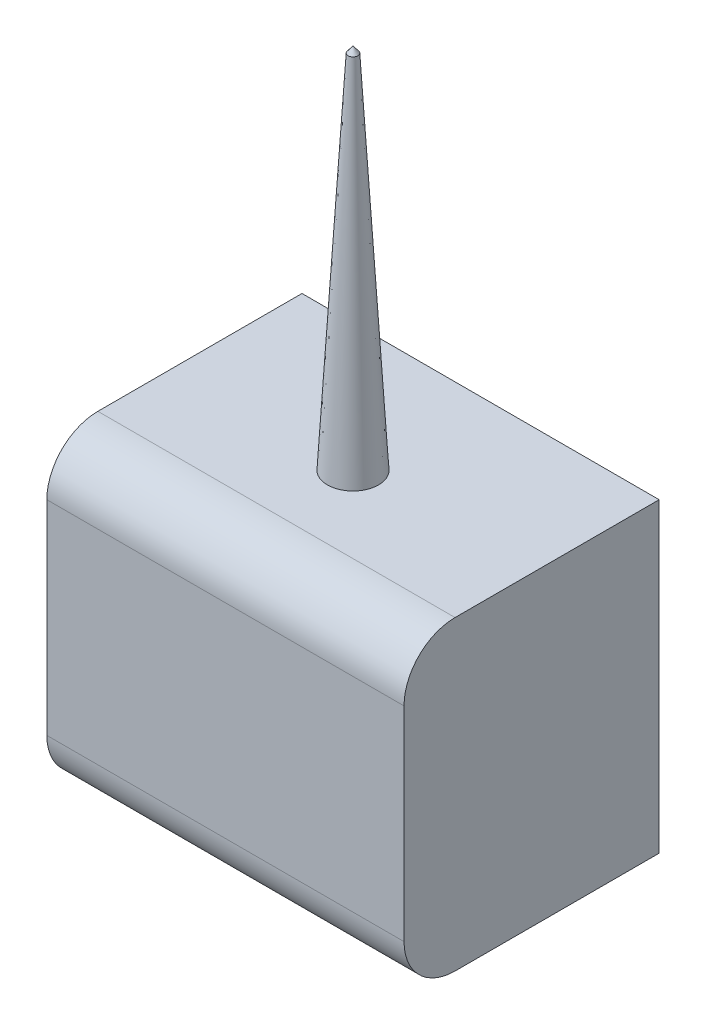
from build123d import *

# Parameters (mm, degrees)
ESQUISSE1_W      = 70
ESQUISSE1_H      = 60
EXTRUSION1_DEPTH = 50
CONG_1_R         = 10
ESQUISSE4_R      = 2.5
EXTRUSION2_DEPTH = 2
ESQUISSE5_W      = 10
ESQUISSE5_H      = 10
ESQUISSE5_R      = 2.5
EXTRUSION3_DEPTH = 2


with BuildPart() as part:
    # Esquisse1 → Extrusion1 (new body)
    with BuildSketch(Plane.XY):
        with Locations((35, 30)):
            Rectangle(ESQUISSE1_W, ESQUISSE1_H)
    extrude(amount=EXTRUSION1_DEPTH)

    # Cong_1
    cong_1_edges = [part.edges().sort_by_distance(p)[0] for p in [
        (35, 60, 50),
        (35, 0, 50),
    ]]
    fillet(cong_1_edges, radius=CONG_1_R)

    # Esquisse3 → R_volution1 (revolve)
    with BuildSketch(Plane.XY.offset(25), mode=Mode.PRIVATE) as r_volution1_sk:
        Polygon((35, 132), (34.05711302, 130.815077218), (30, 60), (35, 60), align=None)
    revolve(r_volution1_sk.sketch.rotate(Axis((35, 28.059575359, 25), (0, 1, 0)), 180), axis=Axis((35, 28.059575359, 25), (0, 1, 0)))

    # Esquisse4 → Extrusion2 (cut)
    with BuildSketch(Plane(origin=(0, 0, 0), x_dir=(-1, 0, 0), z_dir=(0, 0, -1))):
        with Locations((-35, 53)):
            Circle(ESQUISSE4_R)
    extrude(amount=-EXTRUSION2_DEPTH, mode=Mode.SUBTRACT)

    # Esquisse5 → Extrusion3 (add)
    with BuildSketch(Plane(origin=(0, 0, 0), x_dir=(-1, 0, 0), z_dir=(0, 0, -1))):
        with Locations((-35, -5)):
            Rectangle(ESQUISSE5_W, ESQUISSE5_H)
        with Locations((-35, -6.5)):
            Circle(ESQUISSE5_R, mode=Mode.SUBTRACT)
    extrude(amount=-EXTRUSION3_DEPTH)


solid = part.part
